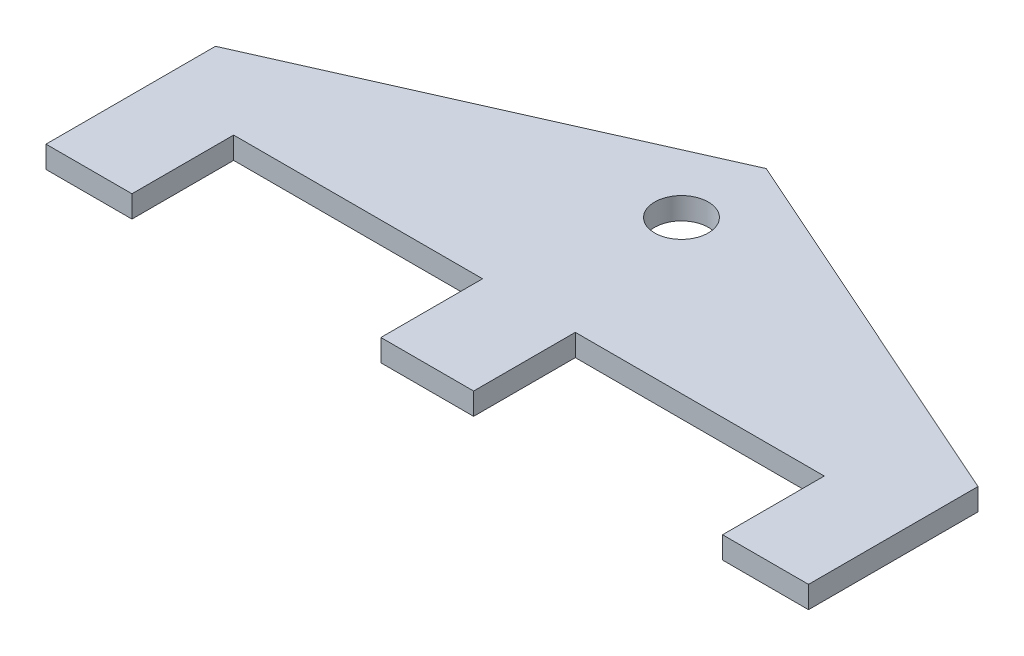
ISO-10303-21;
HEADER;
FILE_DESCRIPTION(('STEP AP214'),'2;1');
FILE_NAME('part.step','',(''),(''),'','','');
FILE_SCHEMA(('AUTOMOTIVE_DESIGN { 1 0 10303 214 1 1 1 1 }'));
ENDSEC;
DATA;
#1=APPLICATION_CONTEXT('core data for automotive mechanical design processes');
#2=APPLICATION_PROTOCOL_DEFINITION('international standard','automotive_design',2000,#1);
#3=PRODUCT_CONTEXT('',#1,'mechanical');
#4=PRODUCT('Part','Part','',(#3));
#5=PRODUCT_RELATED_PRODUCT_CATEGORY('part','',(#4));
#6=PRODUCT_DEFINITION_FORMATION('','',#4);
#7=PRODUCT_DEFINITION_CONTEXT('part definition',#1,'design');
#8=PRODUCT_DEFINITION('design','',#6,#7);
#9=PRODUCT_DEFINITION_SHAPE('','',#8);
#10=(LENGTH_UNIT() NAMED_UNIT(*) SI_UNIT(.MILLI.,.METRE.));
#11=(NAMED_UNIT(*) PLANE_ANGLE_UNIT() SI_UNIT($,.RADIAN.));
#12=(NAMED_UNIT(*) SI_UNIT($,.STERADIAN.) SOLID_ANGLE_UNIT());
#13=UNCERTAINTY_MEASURE_WITH_UNIT(LENGTH_MEASURE(1.E-05),#10,'distance_accuracy_value','');
#14=(GEOMETRIC_REPRESENTATION_CONTEXT(3) GLOBAL_UNCERTAINTY_ASSIGNED_CONTEXT((#13)) GLOBAL_UNIT_ASSIGNED_CONTEXT((#10,
#11,#12)) REPRESENTATION_CONTEXT('',''));
#15=CARTESIAN_POINT('',(0.,0.,0.));
#16=DIRECTION('',(0.,0.,1.));
#17=DIRECTION('',(1.,0.,0.));
#18=AXIS2_PLACEMENT_3D('',#15,#16,#17);
#19=CARTESIAN_POINT('',(-35.7124,2.0574,23.8125));
#20=DIRECTION('',(0.,0.,-1.));
#21=DIRECTION('',(-1.,0.,0.));
#22=AXIS2_PLACEMENT_3D('',#19,#20,#21);
#23=PLANE('',#22);
#24=DIRECTION('',(1.,0.,0.));
#25=VECTOR('',#24,1.);
#26=CARTESIAN_POINT('',(-35.7124,2.0574,23.8125));
#27=LINE('',#26,#25);
#28=CARTESIAN_POINT('',(27.6606,2.0574,23.8125));
#29=VERTEX_POINT('',#28);
#30=CARTESIAN_POINT('',(35.7124,2.0574,23.8125));
#31=VERTEX_POINT('',#30);
#32=EDGE_CURVE('E201',#29,#31,#27,.T.);
#33=ORIENTED_EDGE('',*,*,#32,.F.);
#34=DIRECTION('',(0.,1.,0.));
#35=VECTOR('',#34,1.);
#36=CARTESIAN_POINT('',(27.6606,0.,23.8125));
#37=LINE('',#36,#35);
#38=CARTESIAN_POINT('',(27.6606,0.,23.8125));
#39=VERTEX_POINT('',#38);
#40=EDGE_CURVE('E162',#39,#29,#37,.T.);
#41=ORIENTED_EDGE('',*,*,#40,.F.);
#42=DIRECTION('',(1.,0.,0.));
#43=VECTOR('',#42,1.);
#44=CARTESIAN_POINT('',(-35.7124,0.,23.8125));
#45=LINE('',#44,#43);
#46=CARTESIAN_POINT('',(35.7124,0.,23.8125));
#47=VERTEX_POINT('',#46);
#48=EDGE_CURVE('E154',#39,#47,#45,.T.);
#49=ORIENTED_EDGE('',*,*,#48,.T.);
#50=DIRECTION('',(0.,-1.,0.));
#51=VECTOR('',#50,1.);
#52=CARTESIAN_POINT('',(35.7124,2.0574,23.8125));
#53=LINE('',#52,#51);
#54=EDGE_CURVE('E43',#31,#47,#53,.T.);
#55=ORIENTED_EDGE('',*,*,#54,.F.);
#56=EDGE_LOOP('',(#33,#41,#49,#55));
#57=FACE_BOUND('',#56,.T.);
#58=ADVANCED_FACE('F35',(#57),#23,.F.);
#59=CARTESIAN_POINT('',(-35.7124,0.,23.8125));
#60=VERTEX_POINT('',#59);
#61=CARTESIAN_POINT('',(-27.6606,0.,23.8125));
#62=VERTEX_POINT('',#61);
#63=EDGE_CURVE('E216',#60,#62,#45,.T.);
#64=ORIENTED_EDGE('',*,*,#63,.T.);
#65=DIRECTION('',(0.,1.,0.));
#66=VECTOR('',#65,1.);
#67=CARTESIAN_POINT('',(-27.6606,0.,23.8125));
#68=LINE('',#67,#66);
#69=CARTESIAN_POINT('',(-27.6606,2.0574,23.8125));
#70=VERTEX_POINT('',#69);
#71=EDGE_CURVE('E176',#62,#70,#68,.T.);
#72=ORIENTED_EDGE('',*,*,#71,.T.);
#73=CARTESIAN_POINT('',(-35.7124,2.0574,23.8125));
#74=VERTEX_POINT('',#73);
#75=EDGE_CURVE('E203',#74,#70,#27,.T.);
#76=ORIENTED_EDGE('',*,*,#75,.F.);
#77=DIRECTION('',(0.,-1.,0.));
#78=VECTOR('',#77,1.);
#79=CARTESIAN_POINT('',(-35.7124,2.0574,23.8125));
#80=LINE('',#79,#78);
#81=EDGE_CURVE('E11',#74,#60,#80,.T.);
#82=ORIENTED_EDGE('',*,*,#81,.T.);
#83=EDGE_LOOP('',(#64,#72,#76,#82));
#84=FACE_BOUND('',#83,.T.);
#85=ADVANCED_FACE('F266',(#84),#23,.F.);
#86=CARTESIAN_POINT('',(0.,2.0574,0.));
#87=DIRECTION('',(0.,-1.,0.));
#88=DIRECTION('',(0.,0.,-1.));
#89=AXIS2_PLACEMENT_3D('',#86,#87,#88);
#90=PLANE('',#89);
#91=DIRECTION('',(-1.,0.,0.));
#92=VECTOR('',#91,1.);
#93=CARTESIAN_POINT('',(27.6606,2.0574,14.2875));
#94=LINE('',#93,#92);
#95=CARTESIAN_POINT('',(27.6606,2.0574,14.2875));
#96=VERTEX_POINT('',#95);
#97=CARTESIAN_POINT('',(4.3434,2.0574,14.2875));
#98=VERTEX_POINT('',#97);
#99=EDGE_CURVE('E156',#96,#98,#94,.T.);
#100=ORIENTED_EDGE('',*,*,#99,.F.);
#101=DIRECTION('',(0.,0.,-1.));
#102=VECTOR('',#101,1.);
#103=CARTESIAN_POINT('',(27.6606,2.0574,23.8125));
#104=LINE('',#103,#102);
#105=EDGE_CURVE('E136',#29,#96,#104,.T.);
#106=ORIENTED_EDGE('',*,*,#105,.F.);
#107=ORIENTED_EDGE('',*,*,#32,.T.);
#108=DIRECTION('',(0.,0.,-1.));
#109=VECTOR('',#108,1.);
#110=CARTESIAN_POINT('',(35.7124,2.0574,23.8125));
#111=LINE('',#110,#109);
#112=CARTESIAN_POINT('',(35.7124,2.0574,7.9375));
#113=VERTEX_POINT('',#112);
#114=EDGE_CURVE('E206',#31,#113,#111,.T.);
#115=ORIENTED_EDGE('',*,*,#114,.T.);
#116=DIRECTION('',(-0.913784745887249,0.,-0.406198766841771));
#117=VECTOR('',#116,1.);
#118=CARTESIAN_POINT('',(35.7124,2.0574,7.9375));
#119=LINE('',#118,#117);
#120=CARTESIAN_POINT('',(0.,2.0574,-7.9375));
#121=VERTEX_POINT('',#120);
#122=EDGE_CURVE('E209',#113,#121,#119,.T.);
#123=ORIENTED_EDGE('',*,*,#122,.T.);
#124=DIRECTION('',(-0.913784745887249,0.,0.406198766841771));
#125=VECTOR('',#124,1.);
#126=CARTESIAN_POINT('',(-35.7124,2.0574,7.9375));
#127=LINE('',#126,#125);
#128=CARTESIAN_POINT('',(-35.7124,2.0574,7.9375));
#129=VERTEX_POINT('',#128);
#130=EDGE_CURVE('E211',#121,#129,#127,.T.);
#131=ORIENTED_EDGE('',*,*,#130,.T.);
#132=DIRECTION('',(0.,0.,1.));
#133=VECTOR('',#132,1.);
#134=CARTESIAN_POINT('',(-35.7124,2.0574,23.8125));
#135=LINE('',#134,#133);
#136=EDGE_CURVE('E198',#129,#74,#135,.T.);
#137=ORIENTED_EDGE('',*,*,#136,.T.);
#138=ORIENTED_EDGE('',*,*,#75,.T.);
#139=DIRECTION('',(0.,0.,1.));
#140=VECTOR('',#139,1.);
#141=CARTESIAN_POINT('',(-27.6606,2.0574,23.8125));
#142=LINE('',#141,#140);
#143=CARTESIAN_POINT('',(-27.6606,2.0574,14.2875));
#144=VERTEX_POINT('',#143);
#145=EDGE_CURVE('E164',#144,#70,#142,.T.);
#146=ORIENTED_EDGE('',*,*,#145,.F.);
#147=DIRECTION('',(-1.,0.,0.));
#148=VECTOR('',#147,1.);
#149=CARTESIAN_POINT('',(-27.6606,2.0574,14.2875));
#150=LINE('',#149,#148);
#151=CARTESIAN_POINT('',(-4.3434,2.0574,14.2875));
#152=VERTEX_POINT('',#151);
#153=EDGE_CURVE('E171',#152,#144,#150,.T.);
#154=ORIENTED_EDGE('',*,*,#153,.F.);
#155=DIRECTION('',(0.,0.,-1.));
#156=VECTOR('',#155,1.);
#157=CARTESIAN_POINT('',(-4.3434,2.0574,23.8125));
#158=LINE('',#157,#156);
#159=CARTESIAN_POINT('',(-4.3434,2.0574,23.8125));
#160=VERTEX_POINT('',#159);
#161=EDGE_CURVE('E178',#160,#152,#158,.T.);
#162=ORIENTED_EDGE('',*,*,#161,.F.);
#163=CARTESIAN_POINT('',(4.3434,2.0574,23.8125));
#164=VERTEX_POINT('',#163);
#165=EDGE_CURVE('E207',#160,#164,#27,.T.);
#166=ORIENTED_EDGE('',*,*,#165,.T.);
#167=DIRECTION('',(0.,0.,1.));
#168=VECTOR('',#167,1.);
#169=CARTESIAN_POINT('',(4.3434,2.0574,23.8125));
#170=LINE('',#169,#168);
#171=EDGE_CURVE('E50',#98,#164,#170,.T.);
#172=ORIENTED_EDGE('',*,*,#171,.F.);
#173=EDGE_LOOP('',(#100,#106,#107,#115,#123,#131,#137,#138,#146,#154,#162,#166,#172));
#174=FACE_BOUND('',#173,.T.);
#175=CARTESIAN_POINT('',(0.,2.0574,0.));
#176=DIRECTION('',(0.,1.,0.));
#177=DIRECTION('',(0.,0.,1.));
#178=AXIS2_PLACEMENT_3D('',#175,#176,#177);
#179=CIRCLE('',#178,2.5146);
#180=CARTESIAN_POINT('',(0.,2.0574,2.5146));
#181=VERTEX_POINT('',#180);
#182=EDGE_CURVE('E192',#181,#181,#179,.T.);
#183=ORIENTED_EDGE('',*,*,#182,.F.);
#184=EDGE_LOOP('',(#183));
#185=FACE_BOUND('',#184,.T.);
#186=ADVANCED_FACE('F253',(#174,#185),#90,.F.);
#187=CARTESIAN_POINT('',(0.,0.,0.));
#188=DIRECTION('',(0.,-1.,0.));
#189=DIRECTION('',(0.,0.,-1.));
#190=AXIS2_PLACEMENT_3D('',#187,#188,#189);
#191=PLANE('',#190);
#192=DIRECTION('',(0.,0.,-1.));
#193=VECTOR('',#192,1.);
#194=CARTESIAN_POINT('',(27.6606,0.,23.8125));
#195=LINE('',#194,#193);
#196=CARTESIAN_POINT('',(27.6606,0.,14.2875));
#197=VERTEX_POINT('',#196);
#198=EDGE_CURVE('E133',#39,#197,#195,.T.);
#199=ORIENTED_EDGE('',*,*,#198,.T.);
#200=DIRECTION('',(-1.,0.,0.));
#201=VECTOR('',#200,1.);
#202=CARTESIAN_POINT('',(27.6606,0.,14.2875));
#203=LINE('',#202,#201);
#204=CARTESIAN_POINT('',(4.3434,0.,14.2875));
#205=VERTEX_POINT('',#204);
#206=EDGE_CURVE('E144',#197,#205,#203,.T.);
#207=ORIENTED_EDGE('',*,*,#206,.T.);
#208=DIRECTION('',(0.,0.,1.));
#209=VECTOR('',#208,1.);
#210=CARTESIAN_POINT('',(4.3434,0.,23.8125));
#211=LINE('',#210,#209);
#212=CARTESIAN_POINT('',(4.3434,0.,23.8125));
#213=VERTEX_POINT('',#212);
#214=EDGE_CURVE('E141',#205,#213,#211,.T.);
#215=ORIENTED_EDGE('',*,*,#214,.T.);
#216=CARTESIAN_POINT('',(-4.3434,0.,23.8125));
#217=VERTEX_POINT('',#216);
#218=EDGE_CURVE('E220',#217,#213,#45,.T.);
#219=ORIENTED_EDGE('',*,*,#218,.F.);
#220=DIRECTION('',(0.,0.,-1.));
#221=VECTOR('',#220,1.);
#222=CARTESIAN_POINT('',(-4.3434,0.,23.8125));
#223=LINE('',#222,#221);
#224=CARTESIAN_POINT('',(-4.3434,0.,14.2875));
#225=VERTEX_POINT('',#224);
#226=EDGE_CURVE('E58',#217,#225,#223,.T.);
#227=ORIENTED_EDGE('',*,*,#226,.T.);
#228=DIRECTION('',(-1.,0.,0.));
#229=VECTOR('',#228,1.);
#230=CARTESIAN_POINT('',(-27.6606,0.,14.2875));
#231=LINE('',#230,#229);
#232=CARTESIAN_POINT('',(-27.6606,0.,14.2875));
#233=VERTEX_POINT('',#232);
#234=EDGE_CURVE('E173',#225,#233,#231,.T.);
#235=ORIENTED_EDGE('',*,*,#234,.T.);
#236=DIRECTION('',(0.,0.,1.));
#237=VECTOR('',#236,1.);
#238=CARTESIAN_POINT('',(-27.6606,0.,23.8125));
#239=LINE('',#238,#237);
#240=EDGE_CURVE('E168',#233,#62,#239,.T.);
#241=ORIENTED_EDGE('',*,*,#240,.T.);
#242=ORIENTED_EDGE('',*,*,#63,.F.);
#243=DIRECTION('',(0.,0.,1.));
#244=VECTOR('',#243,1.);
#245=CARTESIAN_POINT('',(-35.7124,0.,23.8125));
#246=LINE('',#245,#244);
#247=CARTESIAN_POINT('',(-35.7124,0.,7.9375));
#248=VERTEX_POINT('',#247);
#249=EDGE_CURVE('E195',#248,#60,#246,.T.);
#250=ORIENTED_EDGE('',*,*,#249,.F.);
#251=DIRECTION('',(-0.913784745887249,0.,0.406198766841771));
#252=VECTOR('',#251,1.);
#253=CARTESIAN_POINT('',(-35.7124,0.,7.9375));
#254=LINE('',#253,#252);
#255=CARTESIAN_POINT('',(0.,0.,-7.9375));
#256=VERTEX_POINT('',#255);
#257=EDGE_CURVE('E202',#256,#248,#254,.T.);
#258=ORIENTED_EDGE('',*,*,#257,.F.);
#259=DIRECTION('',(-0.913784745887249,0.,-0.406198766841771));
#260=VECTOR('',#259,1.);
#261=CARTESIAN_POINT('',(35.7124,0.,7.9375));
#262=LINE('',#261,#260);
#263=CARTESIAN_POINT('',(35.7124,0.,7.9375));
#264=VERTEX_POINT('',#263);
#265=EDGE_CURVE('E222',#264,#256,#262,.T.);
#266=ORIENTED_EDGE('',*,*,#265,.F.);
#267=DIRECTION('',(0.,0.,-1.));
#268=VECTOR('',#267,1.);
#269=CARTESIAN_POINT('',(35.7124,0.,23.8125));
#270=LINE('',#269,#268);
#271=EDGE_CURVE('E219',#47,#264,#270,.T.);
#272=ORIENTED_EDGE('',*,*,#271,.F.);
#273=ORIENTED_EDGE('',*,*,#48,.F.);
#274=EDGE_LOOP('',(#199,#207,#215,#219,#227,#235,#241,#242,#250,#258,#266,#272,#273));
#275=FACE_BOUND('',#274,.T.);
#276=CARTESIAN_POINT('',(0.,0.,0.));
#277=DIRECTION('',(0.,1.,0.));
#278=DIRECTION('',(0.,0.,1.));
#279=AXIS2_PLACEMENT_3D('',#276,#277,#278);
#280=CIRCLE('',#279,2.5146);
#281=CARTESIAN_POINT('',(0.,0.,2.5146));
#282=VERTEX_POINT('',#281);
#283=EDGE_CURVE('E185',#282,#282,#280,.T.);
#284=ORIENTED_EDGE('',*,*,#283,.T.);
#285=EDGE_LOOP('',(#284));
#286=FACE_BOUND('',#285,.T.);
#287=ADVANCED_FACE('F151',(#275,#286),#191,.T.);
#288=CARTESIAN_POINT('',(-35.7124,2.0574,23.8125));
#289=DIRECTION('',(1.,0.,0.));
#290=DIRECTION('',(0.,0.,-1.));
#291=AXIS2_PLACEMENT_3D('',#288,#289,#290);
#292=PLANE('',#291);
#293=ORIENTED_EDGE('',*,*,#249,.T.);
#294=ORIENTED_EDGE('',*,*,#81,.F.);
#295=ORIENTED_EDGE('',*,*,#136,.F.);
#296=DIRECTION('',(0.,-1.,0.));
#297=VECTOR('',#296,1.);
#298=CARTESIAN_POINT('',(-35.7124,2.0574,7.9375));
#299=LINE('',#298,#297);
#300=EDGE_CURVE('E213',#129,#248,#299,.T.);
#301=ORIENTED_EDGE('',*,*,#300,.T.);
#302=EDGE_LOOP('',(#293,#294,#295,#301));
#303=FACE_BOUND('',#302,.T.);
#304=ADVANCED_FACE('F37',(#303),#292,.F.);
#305=ORIENTED_EDGE('',*,*,#218,.T.);
#306=DIRECTION('',(0.,1.,0.));
#307=VECTOR('',#306,1.);
#308=CARTESIAN_POINT('',(4.3434,0.,23.8125));
#309=LINE('',#308,#307);
#310=EDGE_CURVE('E165',#213,#164,#309,.T.);
#311=ORIENTED_EDGE('',*,*,#310,.T.);
#312=ORIENTED_EDGE('',*,*,#165,.F.);
#313=DIRECTION('',(0.,1.,0.));
#314=VECTOR('',#313,1.);
#315=CARTESIAN_POINT('',(-4.3434,0.,23.8125));
#316=LINE('',#315,#314);
#317=EDGE_CURVE('E188',#217,#160,#316,.T.);
#318=ORIENTED_EDGE('',*,*,#317,.F.);
#319=EDGE_LOOP('',(#305,#311,#312,#318));
#320=FACE_BOUND('',#319,.T.);
#321=ADVANCED_FACE('F262',(#320),#23,.F.);
#322=CARTESIAN_POINT('',(35.7124,2.0574,23.8125));
#323=DIRECTION('',(-1.,0.,0.));
#324=DIRECTION('',(0.,0.,1.));
#325=AXIS2_PLACEMENT_3D('',#322,#323,#324);
#326=PLANE('',#325);
#327=ORIENTED_EDGE('',*,*,#271,.T.);
#328=DIRECTION('',(0.,-1.,0.));
#329=VECTOR('',#328,1.);
#330=CARTESIAN_POINT('',(35.7124,2.0574,7.9375));
#331=LINE('',#330,#329);
#332=EDGE_CURVE('E230',#113,#264,#331,.T.);
#333=ORIENTED_EDGE('',*,*,#332,.F.);
#334=ORIENTED_EDGE('',*,*,#114,.F.);
#335=ORIENTED_EDGE('',*,*,#54,.T.);
#336=EDGE_LOOP('',(#327,#333,#334,#335));
#337=FACE_BOUND('',#336,.T.);
#338=ADVANCED_FACE('F236',(#337),#326,.F.);
#339=CARTESIAN_POINT('',(35.7124,2.0574,7.9375));
#340=DIRECTION('',(-0.406198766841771,0.,0.913784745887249));
#341=DIRECTION('',(0.913784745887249,0.,0.406198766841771));
#342=AXIS2_PLACEMENT_3D('',#339,#340,#341);
#343=PLANE('',#342);
#344=ORIENTED_EDGE('',*,*,#265,.T.);
#345=DIRECTION('',(0.,-1.,0.));
#346=VECTOR('',#345,1.);
#347=CARTESIAN_POINT('',(0.,2.0574,-7.9375));
#348=LINE('',#347,#346);
#349=EDGE_CURVE('E227',#121,#256,#348,.T.);
#350=ORIENTED_EDGE('',*,*,#349,.F.);
#351=ORIENTED_EDGE('',*,*,#122,.F.);
#352=ORIENTED_EDGE('',*,*,#332,.T.);
#353=EDGE_LOOP('',(#344,#350,#351,#352));
#354=FACE_BOUND('',#353,.T.);
#355=ADVANCED_FACE('F245',(#354),#343,.F.);
#356=CARTESIAN_POINT('',(-35.7124,2.0574,7.9375));
#357=DIRECTION('',(0.406198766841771,0.,0.913784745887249));
#358=DIRECTION('',(0.913784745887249,0.,-0.406198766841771));
#359=AXIS2_PLACEMENT_3D('',#356,#357,#358);
#360=PLANE('',#359);
#361=ORIENTED_EDGE('',*,*,#257,.T.);
#362=ORIENTED_EDGE('',*,*,#300,.F.);
#363=ORIENTED_EDGE('',*,*,#130,.F.);
#364=ORIENTED_EDGE('',*,*,#349,.T.);
#365=EDGE_LOOP('',(#361,#362,#363,#364));
#366=FACE_BOUND('',#365,.T.);
#367=ADVANCED_FACE('F249',(#366),#360,.F.);
#368=CARTESIAN_POINT('',(0.,2.0574,0.));
#369=DIRECTION('',(0.,-1.,0.));
#370=DIRECTION('',(0.,0.,-1.));
#371=AXIS2_PLACEMENT_3D('',#368,#369,#370);
#372=CYLINDRICAL_SURFACE('',#371,2.5146);
#373=ORIENTED_EDGE('',*,*,#182,.T.);
#374=EDGE_LOOP('',(#373));
#375=FACE_BOUND('',#374,.T.);
#376=ORIENTED_EDGE('',*,*,#283,.F.);
#377=EDGE_LOOP('',(#376));
#378=FACE_BOUND('',#377,.T.);
#379=ADVANCED_FACE('F301',(#375,#378),#372,.F.);
#380=CARTESIAN_POINT('',(-27.6606,0.,23.8125));
#381=DIRECTION('',(-1.,0.,0.));
#382=DIRECTION('',(0.,0.,1.));
#383=AXIS2_PLACEMENT_3D('',#380,#381,#382);
#384=PLANE('',#383);
#385=ORIENTED_EDGE('',*,*,#145,.T.);
#386=ORIENTED_EDGE('',*,*,#71,.F.);
#387=ORIENTED_EDGE('',*,*,#240,.F.);
#388=DIRECTION('',(0.,1.,0.));
#389=VECTOR('',#388,1.);
#390=CARTESIAN_POINT('',(-27.6606,0.,14.2875));
#391=LINE('',#390,#389);
#392=EDGE_CURVE('E183',#233,#144,#391,.T.);
#393=ORIENTED_EDGE('',*,*,#392,.T.);
#394=EDGE_LOOP('',(#385,#386,#387,#393));
#395=FACE_BOUND('',#394,.T.);
#396=ADVANCED_FACE('F285',(#395),#384,.F.);
#397=CARTESIAN_POINT('',(-27.6606,0.,14.2875));
#398=DIRECTION('',(0.,0.,-1.));
#399=DIRECTION('',(-1.,0.,0.));
#400=AXIS2_PLACEMENT_3D('',#397,#398,#399);
#401=PLANE('',#400);
#402=ORIENTED_EDGE('',*,*,#153,.T.);
#403=ORIENTED_EDGE('',*,*,#392,.F.);
#404=ORIENTED_EDGE('',*,*,#234,.F.);
#405=DIRECTION('',(0.,1.,0.));
#406=VECTOR('',#405,1.);
#407=CARTESIAN_POINT('',(-4.3434,0.,14.2875));
#408=LINE('',#407,#406);
#409=EDGE_CURVE('E186',#225,#152,#408,.T.);
#410=ORIENTED_EDGE('',*,*,#409,.T.);
#411=EDGE_LOOP('',(#402,#403,#404,#410));
#412=FACE_BOUND('',#411,.T.);
#413=ADVANCED_FACE('F288',(#412),#401,.F.);
#414=CARTESIAN_POINT('',(-4.3434,0.,23.8125));
#415=DIRECTION('',(1.,0.,0.));
#416=DIRECTION('',(0.,0.,-1.));
#417=AXIS2_PLACEMENT_3D('',#414,#415,#416);
#418=PLANE('',#417);
#419=ORIENTED_EDGE('',*,*,#161,.T.);
#420=ORIENTED_EDGE('',*,*,#409,.F.);
#421=ORIENTED_EDGE('',*,*,#226,.F.);
#422=ORIENTED_EDGE('',*,*,#317,.T.);
#423=EDGE_LOOP('',(#419,#420,#421,#422));
#424=FACE_BOUND('',#423,.T.);
#425=ADVANCED_FACE('F289',(#424),#418,.F.);
#426=CARTESIAN_POINT('',(27.6606,0.,23.8125));
#427=DIRECTION('',(1.,0.,0.));
#428=DIRECTION('',(0.,0.,-1.));
#429=AXIS2_PLACEMENT_3D('',#426,#427,#428);
#430=PLANE('',#429);
#431=ORIENTED_EDGE('',*,*,#105,.T.);
#432=DIRECTION('',(0.,1.,0.));
#433=VECTOR('',#432,1.);
#434=CARTESIAN_POINT('',(27.6606,0.,14.2875));
#435=LINE('',#434,#433);
#436=EDGE_CURVE('E129',#197,#96,#435,.T.);
#437=ORIENTED_EDGE('',*,*,#436,.F.);
#438=ORIENTED_EDGE('',*,*,#198,.F.);
#439=ORIENTED_EDGE('',*,*,#40,.T.);
#440=EDGE_LOOP('',(#431,#437,#438,#439));
#441=FACE_BOUND('',#440,.T.);
#442=ADVANCED_FACE('F131',(#441),#430,.F.);
#443=CARTESIAN_POINT('',(4.3434,0.,23.8125));
#444=DIRECTION('',(-1.,0.,0.));
#445=DIRECTION('',(0.,0.,1.));
#446=AXIS2_PLACEMENT_3D('',#443,#444,#445);
#447=PLANE('',#446);
#448=ORIENTED_EDGE('',*,*,#171,.T.);
#449=ORIENTED_EDGE('',*,*,#310,.F.);
#450=ORIENTED_EDGE('',*,*,#214,.F.);
#451=DIRECTION('',(0.,1.,0.));
#452=VECTOR('',#451,1.);
#453=CARTESIAN_POINT('',(4.3434,0.,14.2875));
#454=LINE('',#453,#452);
#455=EDGE_CURVE('E140',#205,#98,#454,.T.);
#456=ORIENTED_EDGE('',*,*,#455,.T.);
#457=EDGE_LOOP('',(#448,#449,#450,#456));
#458=FACE_BOUND('',#457,.T.);
#459=ADVANCED_FACE('F264',(#458),#447,.F.);
#460=CARTESIAN_POINT('',(27.6606,0.,14.2875));
#461=DIRECTION('',(0.,0.,-1.));
#462=DIRECTION('',(-1.,0.,0.));
#463=AXIS2_PLACEMENT_3D('',#460,#461,#462);
#464=PLANE('',#463);
#465=ORIENTED_EDGE('',*,*,#99,.T.);
#466=ORIENTED_EDGE('',*,*,#455,.F.);
#467=ORIENTED_EDGE('',*,*,#206,.F.);
#468=ORIENTED_EDGE('',*,*,#436,.T.);
#469=EDGE_LOOP('',(#465,#466,#467,#468));
#470=FACE_BOUND('',#469,.T.);
#471=ADVANCED_FACE('F145',(#470),#464,.F.);
#472=CLOSED_SHELL('',(#58,#85,#186,#287,#304,#321,#338,#355,#367,#379,#396,#413,#425,#442,#459,#471));
#473=MANIFOLD_SOLID_BREP('B2',#472);
#474=ADVANCED_BREP_SHAPE_REPRESENTATION('',(#18,#473),#14);
#475=SHAPE_DEFINITION_REPRESENTATION(#9,#474);
ENDSEC;
END-ISO-10303-21;
